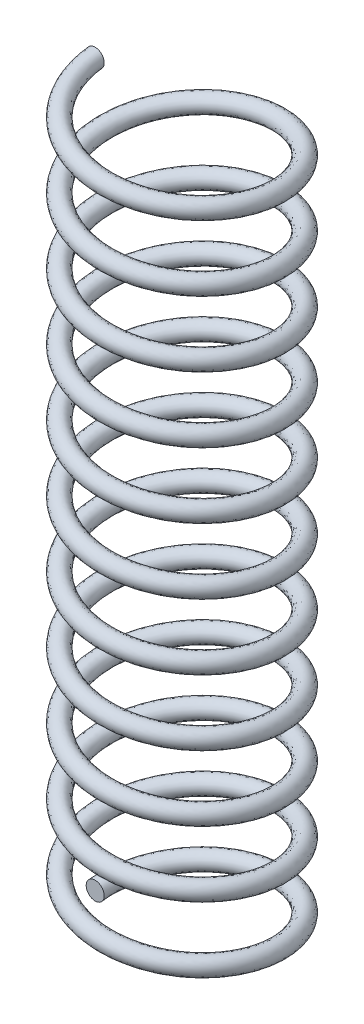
from build123d import *

# Parameters (mm, degrees)
BASE_BALAYAGE_PITCH       = 2.909090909
BASE_BALAYAGE_HEIGHT      = 32
BASE_BALAYAGE_RADIUS      = 4.25
BASE_BALAYAGE_START_ANGLE = -90
ESQUISSE1_R               = 0.4


with BuildPart() as part:
    # Base-Balayage: sweep along a helix
    with BuildLine() as base_balayage_path:
        add(Helix(BASE_BALAYAGE_PITCH, BASE_BALAYAGE_HEIGHT, BASE_BALAYAGE_RADIUS, center=(0, 0, 0), direction=(0, 1, 0), lefthand=True, mode=Mode.PRIVATE).rotate(Axis((0, 0, 0), (0, 1, 0)), BASE_BALAYAGE_START_ANGLE))
    # Esquisse1 → Base-Balayage (sweep)
    with BuildSketch(Plane.XY):
        with Locations((-3.85, 0)):
            Circle(ESQUISSE1_R)
    sweep(path=base_balayage_path.line, is_frenet=True)


solid = part.part
